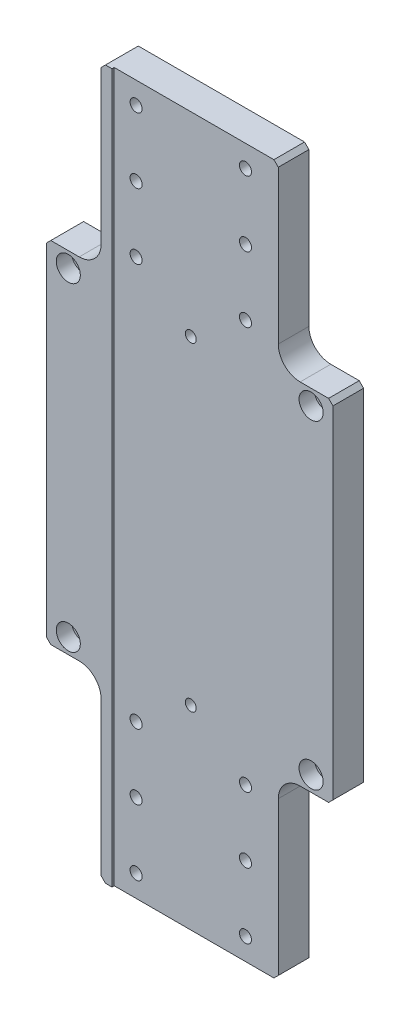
from build123d import *

# Parameters (mm, degrees)
EXTRUDE_1_DEPTH              = 7.5
SKETCH_2_W                   = 100
SKETCH_2_H                   = 324
CUT_EXTRUDE_1_DEPTH          = 1
HOLE_WIZARD_M5_1_D           = 5.5
HOLE_WIZARD_M5_1_CBORE_D     = 9.5
HOLE_WIZARD_M5_1_CBORE_DEPTH = 8
PATTERN_LINEAR_1_COUNT       = 2
PATTERN_LINEAR_1_PITCH       = 244
HOLE_WIZARD_M6_1_D           = 6.6
HOLE_WIZARD_M6_1_CBORE_D     = 11
HOLE_WIZARD_M6_1_CBORE_DEPTH = 7
HOLE_WIZARD_M6_2_D           = 6.6
HOLE_WIZARD_M6_2_CBORE_D     = 11
HOLE_WIZARD_M6_2_CBORE_DEPTH = 7
F_5_0MM_1_D                  = 5
FILLET_1_R                   = 10
CHAMFER_1_SIZE               = 2


with BuildPart() as part:
    # Sketch 1 → Extrude 1 (new, symmetric)
    with BuildSketch(Plane.XY):
        Polygon((40, 80), (65, 80), (65, -80), (40, -80), (40, -162), (-40, -162), (-40, -80), (-65, -80), (-65, 80), (-40, 80), (-40, 162), (40, 162), align=None)
    extrude(amount=EXTRUDE_1_DEPTH, both=True)

    # Sketch 2 → Cut-Extrude 1 (cut)
    with BuildSketch(Plane.XY.offset(7.5)):
        with Locations((15, 0)):
            Rectangle(SKETCH_2_W, SKETCH_2_H)
    extrude(amount=-CUT_EXTRUDE_1_DEPTH, mode=Mode.SUBTRACT)

    # Hole Wizard M5 _ _ _ _ _1 (through all)
    with Locations(Plane(origin=(0, 0, -7.5), x_dir=(-1, 0, 0), z_dir=(0, 0, -1))):
        with Locations((-25, 152), (25, 152), (-25, 122), (25, 122), (-25, 92), (25, 92)):
            hole_wizard_m5_1 = CounterBoreHole(HOLE_WIZARD_M5_1_D / 2, HOLE_WIZARD_M5_1_CBORE_D / 2, HOLE_WIZARD_M5_1_CBORE_DEPTH)

    # Pattern Linear 1: Hole Wizard M5 _ _ _ _ _1 ×2
    with Locations(*[(0, -i * PATTERN_LINEAR_1_PITCH, 0) for i in range(1, PATTERN_LINEAR_1_COUNT)]):
        add(hole_wizard_m5_1, mode=Mode.SUBTRACT)

    # Hole Wizard M6 _ _ _ _ _1 (through all)
    with Locations(Plane.XY.offset(7.5)):
        with Locations((-55, 73), (-55, -73)):
            CounterBoreHole(HOLE_WIZARD_M6_1_D / 2, HOLE_WIZARD_M6_1_CBORE_D / 2, HOLE_WIZARD_M6_1_CBORE_DEPTH)

    # Hole Wizard M6 _ _ _ _ _2 (through all)
    with Locations(Plane.XY.offset(6.5)):
        with Locations((55, 73), (55, -73)):
            CounterBoreHole(HOLE_WIZARD_M6_2_D / 2, HOLE_WIZARD_M6_2_CBORE_D / 2, HOLE_WIZARD_M6_2_CBORE_DEPTH)

    # 5.0mm _ _1 (through all)
    with Locations(Plane.XY.offset(6.5)):
        with Locations((0, -73), (0, 73)):
            Hole(F_5_0MM_1_D / 2)

    # Fillet 1
    fillet_1_edges = [part.edges().sort_by_distance(p)[0] for p in [
        (-40, -80, 0),
        (-40, 80, 0),
        (40, 80, -0.5),
        (40, -80, -0.5),
    ]]
    fillet(fillet_1_edges, radius=FILLET_1_R)

    # Chamfer 1
    chamfer_1_edges = [part.edges().sort_by_distance(p)[0] for p in [
        (-40, -162, 0),
        (-65, -80, 0),
        (-65, 80, 0),
        (-40, 162, 0),
        (40, -162, -0.5),
        (40, 162, -0.5),
        (65, 80, -0.5),
        (65, -80, -0.5),
    ]]
    chamfer(chamfer_1_edges, length=CHAMFER_1_SIZE)


solid = part.part
